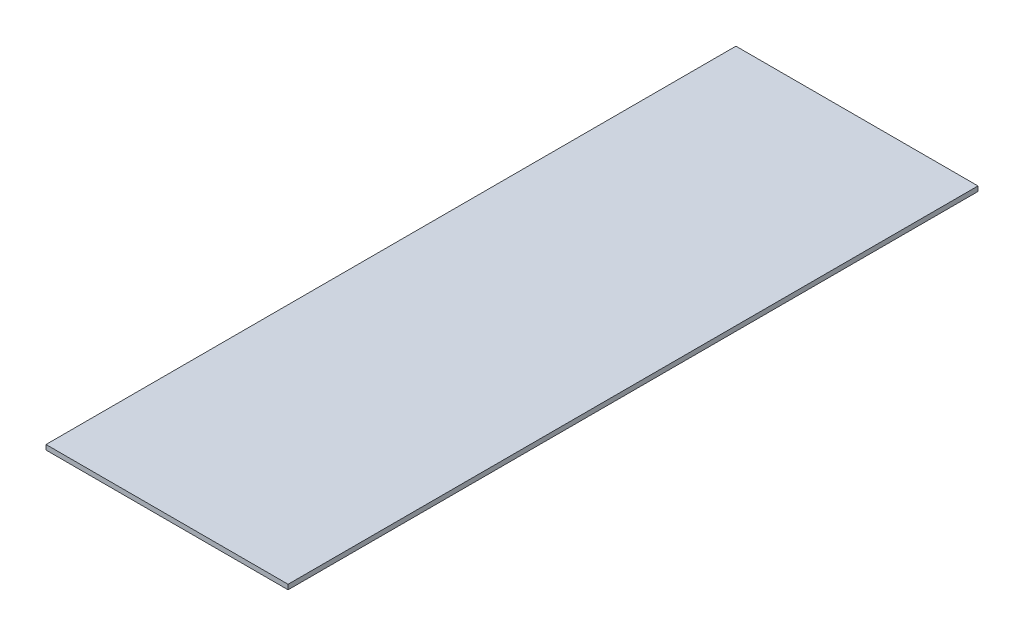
from build123d import *

# Parameters (mm, degrees)
SKETCH2_W           = 127
SKETCH2_H           = 361.95
BOSS_EXTRUDE1_DEPTH = 2.54


with BuildPart() as part:
    # Sketch2 → Boss-Extrude1 (new body)
    with BuildSketch(Plane(origin=(0, 0, 0), x_dir=(1, 0, 0), z_dir=(0, 1, 0))):
        Rectangle(SKETCH2_W, SKETCH2_H)
    extrude(amount=BOSS_EXTRUDE1_DEPTH)


solid = part.part
